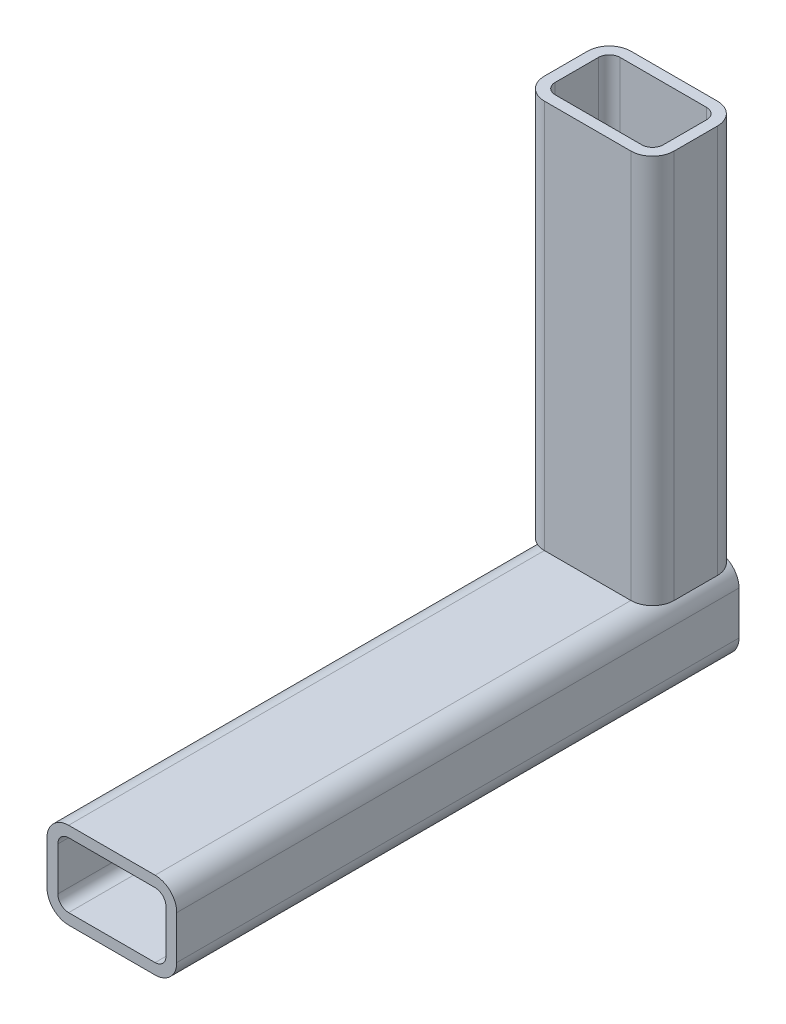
ISO-10303-21;
HEADER;
FILE_DESCRIPTION(('STEP AP214'),'2;1');
FILE_NAME('part.step','',(''),(''),'','','');
FILE_SCHEMA(('AUTOMOTIVE_DESIGN { 1 0 10303 214 1 1 1 1 }'));
ENDSEC;
DATA;
#1=APPLICATION_CONTEXT('core data for automotive mechanical design processes');
#2=APPLICATION_PROTOCOL_DEFINITION('international standard','automotive_design',2000,#1);
#3=PRODUCT_CONTEXT('',#1,'mechanical');
#4=PRODUCT('Part','Part','',(#3));
#5=PRODUCT_RELATED_PRODUCT_CATEGORY('part','',(#4));
#6=PRODUCT_DEFINITION_FORMATION('','',#4);
#7=PRODUCT_DEFINITION_CONTEXT('part definition',#1,'design');
#8=PRODUCT_DEFINITION('design','',#6,#7);
#9=PRODUCT_DEFINITION_SHAPE('','',#8);
#10=(LENGTH_UNIT() NAMED_UNIT(*) SI_UNIT(.MILLI.,.METRE.));
#11=(NAMED_UNIT(*) PLANE_ANGLE_UNIT() SI_UNIT($,.RADIAN.));
#12=(NAMED_UNIT(*) SI_UNIT($,.STERADIAN.) SOLID_ANGLE_UNIT());
#13=UNCERTAINTY_MEASURE_WITH_UNIT(LENGTH_MEASURE(1.E-05),#10,'distance_accuracy_value','');
#14=(GEOMETRIC_REPRESENTATION_CONTEXT(3) GLOBAL_UNCERTAINTY_ASSIGNED_CONTEXT((#13)) GLOBAL_UNIT_ASSIGNED_CONTEXT((#10,
#11,#12)) REPRESENTATION_CONTEXT('',''));
#15=CARTESIAN_POINT('',(0.,0.,0.));
#16=DIRECTION('',(0.,0.,1.));
#17=DIRECTION('',(1.,0.,0.));
#18=AXIS2_PLACEMENT_3D('',#15,#16,#17);
#19=CARTESIAN_POINT('',(-25.4,-12.699978,0.));
#20=DIRECTION('',(0.,0.,1.));
#21=DIRECTION('',(0.,-1.,0.));
#22=AXIS2_PLACEMENT_3D('',#19,#20,#21);
#23=CYLINDRICAL_SURFACE('',#22,12.7);
#24=CARTESIAN_POINT('',(-25.4,-12.699978,-25.399978));
#25=DIRECTION('',(0.,0.,-1.));
#26=DIRECTION('',(-1.,0.,0.));
#27=AXIS2_PLACEMENT_3D('',#24,#25,#26);
#28=CIRCLE('',#27,12.7);
#29=CARTESIAN_POINT('',(-25.4,-25.399978,-25.399978));
#30=VERTEX_POINT('',#29);
#31=CARTESIAN_POINT('',(-38.1,-12.699978,-25.399978));
#32=VERTEX_POINT('',#31);
#33=EDGE_CURVE('E175',#30,#32,#28,.T.);
#34=ORIENTED_EDGE('',*,*,#33,.F.);
#35=DIRECTION('',(0.,0.,1.));
#36=VECTOR('',#35,1.);
#37=CARTESIAN_POINT('',(-25.4,-25.399978,0.));
#38=LINE('',#37,#36);
#39=CARTESIAN_POINT('',(-25.4,-25.399978,304.8));
#40=VERTEX_POINT('',#39);
#41=EDGE_CURVE('E171',#30,#40,#38,.T.);
#42=ORIENTED_EDGE('',*,*,#41,.T.);
#43=CARTESIAN_POINT('',(-25.4,-12.699978,304.8));
#44=DIRECTION('',(0.,0.,-1.));
#45=DIRECTION('',(0.,1.,0.));
#46=AXIS2_PLACEMENT_3D('',#43,#44,#45);
#47=CIRCLE('',#46,12.7);
#48=CARTESIAN_POINT('',(-38.1,-12.699978,304.8));
#49=VERTEX_POINT('',#48);
#50=EDGE_CURVE('E226',#40,#49,#47,.T.);
#51=ORIENTED_EDGE('',*,*,#50,.T.);
#52=DIRECTION('',(0.,0.,1.));
#53=VECTOR('',#52,1.);
#54=CARTESIAN_POINT('',(-38.1,-12.699978,0.));
#55=LINE('',#54,#53);
#56=EDGE_CURVE('E223',#32,#49,#55,.T.);
#57=ORIENTED_EDGE('',*,*,#56,.F.);
#58=EDGE_LOOP('',(#34,#42,#51,#57));
#59=FACE_BOUND('',#58,.T.);
#60=ADVANCED_FACE('F46',(#59),#23,.T.);
#61=CARTESIAN_POINT('',(-38.1,-12.699978,0.));
#62=DIRECTION('',(1.,0.,0.));
#63=DIRECTION('',(0.,0.,-1.));
#64=AXIS2_PLACEMENT_3D('',#61,#62,#63);
#65=PLANE('',#64);
#66=DIRECTION('',(0.,1.,0.));
#67=VECTOR('',#66,1.);
#68=CARTESIAN_POINT('',(-38.1,-12.699978,-25.399978));
#69=LINE('',#68,#67);
#70=CARTESIAN_POINT('',(-38.1,12.699978,-25.399978));
#71=VERTEX_POINT('',#70);
#72=EDGE_CURVE('E193',#32,#71,#69,.T.);
#73=ORIENTED_EDGE('',*,*,#72,.F.);
#74=ORIENTED_EDGE('',*,*,#56,.T.);
#75=DIRECTION('',(0.,1.,0.));
#76=VECTOR('',#75,1.);
#77=CARTESIAN_POINT('',(-38.1,-12.699978,304.8));
#78=LINE('',#77,#76);
#79=CARTESIAN_POINT('',(-38.1,12.699978,304.8));
#80=VERTEX_POINT('',#79);
#81=EDGE_CURVE('E225',#49,#80,#78,.T.);
#82=ORIENTED_EDGE('',*,*,#81,.T.);
#83=DIRECTION('',(0.,0.,1.));
#84=VECTOR('',#83,1.);
#85=CARTESIAN_POINT('',(-38.1,12.699978,0.));
#86=LINE('',#85,#84);
#87=EDGE_CURVE('E227',#71,#80,#86,.T.);
#88=ORIENTED_EDGE('',*,*,#87,.F.);
#89=EDGE_LOOP('',(#73,#74,#82,#88));
#90=FACE_BOUND('',#89,.T.);
#91=ADVANCED_FACE('F298',(#90),#65,.F.);
#92=CARTESIAN_POINT('',(-25.4,12.699978,0.));
#93=DIRECTION('',(0.,0.,1.));
#94=DIRECTION('',(0.,-1.,0.));
#95=AXIS2_PLACEMENT_3D('',#92,#93,#94);
#96=CYLINDRICAL_SURFACE('',#95,12.7);
#97=CARTESIAN_POINT('',(-25.4,12.699978,-25.399978));
#98=DIRECTION('',(0.,0.,-1.));
#99=DIRECTION('',(-1.,0.,0.));
#100=AXIS2_PLACEMENT_3D('',#97,#98,#99);
#101=CIRCLE('',#100,12.7);
#102=CARTESIAN_POINT('',(-25.4,25.399978,-25.399978));
#103=VERTEX_POINT('',#102);
#104=EDGE_CURVE('E190',#71,#103,#101,.T.);
#105=ORIENTED_EDGE('',*,*,#104,.F.);
#106=ORIENTED_EDGE('',*,*,#87,.T.);
#107=CARTESIAN_POINT('',(-25.4,12.699978,304.8));
#108=DIRECTION('',(0.,0.,-1.));
#109=DIRECTION('',(0.,1.,0.));
#110=AXIS2_PLACEMENT_3D('',#107,#108,#109);
#111=CIRCLE('',#110,12.7);
#112=CARTESIAN_POINT('',(-25.4,25.399978,304.8));
#113=VERTEX_POINT('',#112);
#114=EDGE_CURVE('E229',#80,#113,#111,.T.);
#115=ORIENTED_EDGE('',*,*,#114,.T.);
#116=DIRECTION('',(0.,0.,1.));
#117=VECTOR('',#116,1.);
#118=CARTESIAN_POINT('',(-25.4,25.399978,0.));
#119=LINE('',#118,#117);
#120=EDGE_CURVE('E230',#103,#113,#119,.T.);
#121=ORIENTED_EDGE('',*,*,#120,.F.);
#122=EDGE_LOOP('',(#105,#106,#115,#121));
#123=FACE_BOUND('',#122,.T.);
#124=ADVANCED_FACE('F300',(#123),#96,.T.);
#125=CARTESIAN_POINT('',(25.4,25.399978,0.));
#126=DIRECTION('',(0.,-1.,0.));
#127=DIRECTION('',(0.,0.,-1.));
#128=AXIS2_PLACEMENT_3D('',#125,#126,#127);
#129=PLANE('',#128);
#130=DIRECTION('',(1.,0.,0.));
#131=VECTOR('',#130,1.);
#132=CARTESIAN_POINT('',(25.4,25.399978,-25.399978));
#133=LINE('',#132,#131);
#134=CARTESIAN_POINT('',(25.4,25.399978,-25.399978));
#135=VERTEX_POINT('',#134);
#136=EDGE_CURVE('E185',#103,#135,#133,.T.);
#137=ORIENTED_EDGE('',*,*,#136,.F.);
#138=ORIENTED_EDGE('',*,*,#120,.T.);
#139=DIRECTION('',(1.,0.,0.));
#140=VECTOR('',#139,1.);
#141=CARTESIAN_POINT('',(25.4,25.399978,304.8));
#142=LINE('',#141,#140);
#143=CARTESIAN_POINT('',(25.4,25.399978,304.8));
#144=VERTEX_POINT('',#143);
#145=EDGE_CURVE('E232',#113,#144,#142,.T.);
#146=ORIENTED_EDGE('',*,*,#145,.T.);
#147=DIRECTION('',(0.,0.,1.));
#148=VECTOR('',#147,1.);
#149=CARTESIAN_POINT('',(25.4,25.399978,0.));
#150=LINE('',#149,#148);
#151=EDGE_CURVE('E233',#135,#144,#150,.T.);
#152=ORIENTED_EDGE('',*,*,#151,.F.);
#153=EDGE_LOOP('',(#137,#138,#146,#152));
#154=FACE_BOUND('',#153,.T.);
#155=ADVANCED_FACE('F304',(#154),#129,.F.);
#156=CARTESIAN_POINT('',(25.4,12.699978,0.));
#157=DIRECTION('',(0.,0.,1.));
#158=DIRECTION('',(0.,-1.,0.));
#159=AXIS2_PLACEMENT_3D('',#156,#157,#158);
#160=CYLINDRICAL_SURFACE('',#159,12.7);
#161=CARTESIAN_POINT('',(25.4,12.699978,-25.399978));
#162=DIRECTION('',(0.,0.,-1.));
#163=DIRECTION('',(-1.,0.,0.));
#164=AXIS2_PLACEMENT_3D('',#161,#162,#163);
#165=CIRCLE('',#164,12.7);
#166=CARTESIAN_POINT('',(38.1,12.699978,-25.399978));
#167=VERTEX_POINT('',#166);
#168=EDGE_CURVE('E181',#135,#167,#165,.T.);
#169=ORIENTED_EDGE('',*,*,#168,.F.);
#170=ORIENTED_EDGE('',*,*,#151,.T.);
#171=CARTESIAN_POINT('',(25.4,12.699978,304.8));
#172=DIRECTION('',(0.,0.,-1.));
#173=DIRECTION('',(0.,1.,0.));
#174=AXIS2_PLACEMENT_3D('',#171,#172,#173);
#175=CIRCLE('',#174,12.7);
#176=CARTESIAN_POINT('',(38.1,12.699978,304.8));
#177=VERTEX_POINT('',#176);
#178=EDGE_CURVE('E235',#144,#177,#175,.T.);
#179=ORIENTED_EDGE('',*,*,#178,.T.);
#180=DIRECTION('',(0.,0.,1.));
#181=VECTOR('',#180,1.);
#182=CARTESIAN_POINT('',(38.1,12.699978,0.));
#183=LINE('',#182,#181);
#184=EDGE_CURVE('E236',#167,#177,#183,.T.);
#185=ORIENTED_EDGE('',*,*,#184,.F.);
#186=EDGE_LOOP('',(#169,#170,#179,#185));
#187=FACE_BOUND('',#186,.T.);
#188=ADVANCED_FACE('F308',(#187),#160,.T.);
#189=CARTESIAN_POINT('',(38.1,12.699978,0.));
#190=DIRECTION('',(-1.,0.,0.));
#191=DIRECTION('',(0.,0.,1.));
#192=AXIS2_PLACEMENT_3D('',#189,#190,#191);
#193=PLANE('',#192);
#194=DIRECTION('',(0.,-1.,0.));
#195=VECTOR('',#194,1.);
#196=CARTESIAN_POINT('',(38.1,12.699978,-25.399978));
#197=LINE('',#196,#195);
#198=CARTESIAN_POINT('',(38.1,-12.699978,-25.399978));
#199=VERTEX_POINT('',#198);
#200=EDGE_CURVE('E56',#167,#199,#197,.T.);
#201=ORIENTED_EDGE('',*,*,#200,.F.);
#202=ORIENTED_EDGE('',*,*,#184,.T.);
#203=DIRECTION('',(0.,-1.,0.));
#204=VECTOR('',#203,1.);
#205=CARTESIAN_POINT('',(38.1,12.699978,304.8));
#206=LINE('',#205,#204);
#207=CARTESIAN_POINT('',(38.1,-12.699978,304.8));
#208=VERTEX_POINT('',#207);
#209=EDGE_CURVE('E238',#177,#208,#206,.T.);
#210=ORIENTED_EDGE('',*,*,#209,.T.);
#211=DIRECTION('',(0.,0.,1.));
#212=VECTOR('',#211,1.);
#213=CARTESIAN_POINT('',(38.1,-12.699978,0.));
#214=LINE('',#213,#212);
#215=EDGE_CURVE('E239',#199,#208,#214,.T.);
#216=ORIENTED_EDGE('',*,*,#215,.F.);
#217=EDGE_LOOP('',(#201,#202,#210,#216));
#218=FACE_BOUND('',#217,.T.);
#219=ADVANCED_FACE('F310',(#218),#193,.F.);
#220=CARTESIAN_POINT('',(25.4,-12.699978,0.));
#221=DIRECTION('',(0.,0.,1.));
#222=DIRECTION('',(0.,-1.,0.));
#223=AXIS2_PLACEMENT_3D('',#220,#221,#222);
#224=CYLINDRICAL_SURFACE('',#223,12.7);
#225=CARTESIAN_POINT('',(25.4,-12.699978,-25.399978));
#226=DIRECTION('',(0.,0.,-1.));
#227=DIRECTION('',(-1.,0.,0.));
#228=AXIS2_PLACEMENT_3D('',#225,#226,#227);
#229=CIRCLE('',#228,12.7);
#230=CARTESIAN_POINT('',(25.4,-25.399978,-25.399978));
#231=VERTEX_POINT('',#230);
#232=EDGE_CURVE('E12',#199,#231,#229,.T.);
#233=ORIENTED_EDGE('',*,*,#232,.F.);
#234=ORIENTED_EDGE('',*,*,#215,.T.);
#235=CARTESIAN_POINT('',(25.4,-12.699978,304.8));
#236=DIRECTION('',(0.,0.,-1.));
#237=DIRECTION('',(0.,1.,0.));
#238=AXIS2_PLACEMENT_3D('',#235,#236,#237);
#239=CIRCLE('',#238,12.7);
#240=CARTESIAN_POINT('',(25.4,-25.399978,304.8));
#241=VERTEX_POINT('',#240);
#242=EDGE_CURVE('E160',#208,#241,#239,.T.);
#243=ORIENTED_EDGE('',*,*,#242,.T.);
#244=DIRECTION('',(0.,0.,1.));
#245=VECTOR('',#244,1.);
#246=CARTESIAN_POINT('',(25.4,-25.399978,0.));
#247=LINE('',#246,#245);
#248=EDGE_CURVE('E155',#231,#241,#247,.T.);
#249=ORIENTED_EDGE('',*,*,#248,.F.);
#250=EDGE_LOOP('',(#233,#234,#243,#249));
#251=FACE_BOUND('',#250,.T.);
#252=ADVANCED_FACE('F157',(#251),#224,.T.);
#253=CARTESIAN_POINT('',(-25.4,12.699978,0.));
#254=DIRECTION('',(0.,0.,1.));
#255=DIRECTION('',(0.,-1.,0.));
#256=AXIS2_PLACEMENT_3D('',#253,#254,#255);
#257=CYLINDRICAL_SURFACE('',#256,6.35);
#258=DIRECTION('',(0.,0.,1.));
#259=VECTOR('',#258,1.);
#260=CARTESIAN_POINT('',(-31.75,12.699978,0.));
#261=LINE('',#260,#259);
#262=CARTESIAN_POINT('',(-31.75,12.6999780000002,-25.399978));
#263=VERTEX_POINT('',#262);
#264=CARTESIAN_POINT('',(-31.75,12.699978,304.8));
#265=VERTEX_POINT('',#264);
#266=EDGE_CURVE('E202',#263,#265,#261,.T.);
#267=ORIENTED_EDGE('',*,*,#266,.F.);
#268=CARTESIAN_POINT('',(-25.4,12.699978,-25.399978));
#269=DIRECTION('',(0.,0.,-1.));
#270=DIRECTION('',(-1.,0.,0.));
#271=AXIS2_PLACEMENT_3D('',#268,#269,#270);
#272=CIRCLE('',#271,6.35);
#273=CARTESIAN_POINT('',(-25.4,19.049978,-25.399978));
#274=VERTEX_POINT('',#273);
#275=EDGE_CURVE('E197',#263,#274,#272,.T.);
#276=ORIENTED_EDGE('',*,*,#275,.T.);
#277=DIRECTION('',(0.,0.,1.));
#278=VECTOR('',#277,1.);
#279=CARTESIAN_POINT('',(-25.4,19.049978,0.));
#280=LINE('',#279,#278);
#281=CARTESIAN_POINT('',(-25.4,19.049978,304.8));
#282=VERTEX_POINT('',#281);
#283=EDGE_CURVE('E50',#274,#282,#280,.T.);
#284=ORIENTED_EDGE('',*,*,#283,.T.);
#285=CARTESIAN_POINT('',(-25.4,12.699978,304.8));
#286=DIRECTION('',(0.,0.,-1.));
#287=DIRECTION('',(0.,1.,0.));
#288=AXIS2_PLACEMENT_3D('',#285,#286,#287);
#289=CIRCLE('',#288,6.35);
#290=EDGE_CURVE('E253',#265,#282,#289,.T.);
#291=ORIENTED_EDGE('',*,*,#290,.F.);
#292=EDGE_LOOP('',(#267,#276,#284,#291));
#293=FACE_BOUND('',#292,.T.);
#294=ADVANCED_FACE('F317',(#293),#257,.F.);
#295=CARTESIAN_POINT('',(-31.75,-12.699978,0.));
#296=DIRECTION('',(1.,0.,0.));
#297=DIRECTION('',(0.,0.,-1.));
#298=AXIS2_PLACEMENT_3D('',#295,#296,#297);
#299=PLANE('',#298);
#300=DIRECTION('',(0.,0.,1.));
#301=VECTOR('',#300,1.);
#302=CARTESIAN_POINT('',(-31.75,-12.699978,0.));
#303=LINE('',#302,#301);
#304=CARTESIAN_POINT('',(-31.75,-12.699978,-25.399978));
#305=VERTEX_POINT('',#304);
#306=CARTESIAN_POINT('',(-31.75,-12.699978,304.8));
#307=VERTEX_POINT('',#306);
#308=EDGE_CURVE('E206',#305,#307,#303,.T.);
#309=ORIENTED_EDGE('',*,*,#308,.F.);
#310=DIRECTION('',(0.,1.,0.));
#311=VECTOR('',#310,1.);
#312=CARTESIAN_POINT('',(-31.75,-12.699978,-25.399978));
#313=LINE('',#312,#311);
#314=EDGE_CURVE('E199',#305,#263,#313,.T.);
#315=ORIENTED_EDGE('',*,*,#314,.T.);
#316=ORIENTED_EDGE('',*,*,#266,.T.);
#317=DIRECTION('',(0.,1.,0.));
#318=VECTOR('',#317,1.);
#319=CARTESIAN_POINT('',(-31.75,-12.699978,304.8));
#320=LINE('',#319,#318);
#321=EDGE_CURVE('E176',#307,#265,#320,.T.);
#322=ORIENTED_EDGE('',*,*,#321,.F.);
#323=EDGE_LOOP('',(#309,#315,#316,#322));
#324=FACE_BOUND('',#323,.T.);
#325=ADVANCED_FACE('F359',(#324),#299,.T.);
#326=CARTESIAN_POINT('',(-25.4,-12.699978,0.));
#327=DIRECTION('',(0.,0.,1.));
#328=DIRECTION('',(0.,-1.,0.));
#329=AXIS2_PLACEMENT_3D('',#326,#327,#328);
#330=CYLINDRICAL_SURFACE('',#329,6.35);
#331=DIRECTION('',(0.,0.,1.));
#332=VECTOR('',#331,1.);
#333=CARTESIAN_POINT('',(-25.4,-19.049978,0.));
#334=LINE('',#333,#332);
#335=CARTESIAN_POINT('',(-25.4,-19.049978,-25.399978));
#336=VERTEX_POINT('',#335);
#337=CARTESIAN_POINT('',(-25.4,-19.049978,304.8));
#338=VERTEX_POINT('',#337);
#339=EDGE_CURVE('E210',#336,#338,#334,.T.);
#340=ORIENTED_EDGE('',*,*,#339,.F.);
#341=CARTESIAN_POINT('',(-25.4,-12.699978,-25.399978));
#342=DIRECTION('',(0.,0.,-1.));
#343=DIRECTION('',(-1.,0.,0.));
#344=AXIS2_PLACEMENT_3D('',#341,#342,#343);
#345=CIRCLE('',#344,6.35);
#346=EDGE_CURVE('E203',#336,#305,#345,.T.);
#347=ORIENTED_EDGE('',*,*,#346,.T.);
#348=ORIENTED_EDGE('',*,*,#308,.T.);
#349=CARTESIAN_POINT('',(-25.4,-12.699978,304.8));
#350=DIRECTION('',(0.,0.,-1.));
#351=DIRECTION('',(0.,1.,0.));
#352=AXIS2_PLACEMENT_3D('',#349,#350,#351);
#353=CIRCLE('',#352,6.35);
#354=EDGE_CURVE('E259',#338,#307,#353,.T.);
#355=ORIENTED_EDGE('',*,*,#354,.F.);
#356=EDGE_LOOP('',(#340,#347,#348,#355));
#357=FACE_BOUND('',#356,.T.);
#358=ADVANCED_FACE('F370',(#357),#330,.F.);
#359=CARTESIAN_POINT('',(-25.4,-19.049978,0.));
#360=DIRECTION('',(0.,1.,0.));
#361=DIRECTION('',(0.,0.,1.));
#362=AXIS2_PLACEMENT_3D('',#359,#360,#361);
#363=PLANE('',#362);
#364=DIRECTION('',(0.,0.,1.));
#365=VECTOR('',#364,1.);
#366=CARTESIAN_POINT('',(25.4,-19.049978,0.));
#367=LINE('',#366,#365);
#368=CARTESIAN_POINT('',(25.4,-19.049978,-25.399978));
#369=VERTEX_POINT('',#368);
#370=CARTESIAN_POINT('',(25.4,-19.049978,304.8));
#371=VERTEX_POINT('',#370);
#372=EDGE_CURVE('E214',#369,#371,#367,.T.);
#373=ORIENTED_EDGE('',*,*,#372,.F.);
#374=DIRECTION('',(-1.,0.,0.));
#375=VECTOR('',#374,1.);
#376=CARTESIAN_POINT('',(-25.4,-19.049978,-25.399978));
#377=LINE('',#376,#375);
#378=EDGE_CURVE('E207',#369,#336,#377,.T.);
#379=ORIENTED_EDGE('',*,*,#378,.T.);
#380=ORIENTED_EDGE('',*,*,#339,.T.);
#381=DIRECTION('',(-1.,0.,0.));
#382=VECTOR('',#381,1.);
#383=CARTESIAN_POINT('',(-25.4,-19.049978,304.8));
#384=LINE('',#383,#382);
#385=EDGE_CURVE('E262',#371,#338,#384,.T.);
#386=ORIENTED_EDGE('',*,*,#385,.F.);
#387=EDGE_LOOP('',(#373,#379,#380,#386));
#388=FACE_BOUND('',#387,.T.);
#389=ADVANCED_FACE('F381',(#388),#363,.T.);
#390=CARTESIAN_POINT('',(25.4,-12.699978,0.));
#391=DIRECTION('',(0.,0.,1.));
#392=DIRECTION('',(0.,-1.,0.));
#393=AXIS2_PLACEMENT_3D('',#390,#391,#392);
#394=CYLINDRICAL_SURFACE('',#393,6.35);
#395=DIRECTION('',(0.,0.,1.));
#396=VECTOR('',#395,1.);
#397=CARTESIAN_POINT('',(31.75,-12.699978,0.));
#398=LINE('',#397,#396);
#399=CARTESIAN_POINT('',(31.75,-12.699978,-25.399978));
#400=VERTEX_POINT('',#399);
#401=CARTESIAN_POINT('',(31.75,-12.699978,304.8));
#402=VERTEX_POINT('',#401);
#403=EDGE_CURVE('E218',#400,#402,#398,.T.);
#404=ORIENTED_EDGE('',*,*,#403,.F.);
#405=CARTESIAN_POINT('',(25.4,-12.699978,-25.399978));
#406=DIRECTION('',(0.,0.,-1.));
#407=DIRECTION('',(-1.,0.,0.));
#408=AXIS2_PLACEMENT_3D('',#405,#406,#407);
#409=CIRCLE('',#408,6.35);
#410=EDGE_CURVE('E211',#400,#369,#409,.T.);
#411=ORIENTED_EDGE('',*,*,#410,.T.);
#412=ORIENTED_EDGE('',*,*,#372,.T.);
#413=CARTESIAN_POINT('',(25.4,-12.699978,304.8));
#414=DIRECTION('',(0.,0.,-1.));
#415=DIRECTION('',(0.,1.,0.));
#416=AXIS2_PLACEMENT_3D('',#413,#414,#415);
#417=CIRCLE('',#416,6.35);
#418=EDGE_CURVE('E265',#402,#371,#417,.T.);
#419=ORIENTED_EDGE('',*,*,#418,.F.);
#420=EDGE_LOOP('',(#404,#411,#412,#419));
#421=FACE_BOUND('',#420,.T.);
#422=ADVANCED_FACE('F392',(#421),#394,.F.);
#423=CARTESIAN_POINT('',(31.75,12.699978,0.));
#424=DIRECTION('',(-1.,0.,0.));
#425=DIRECTION('',(0.,0.,1.));
#426=AXIS2_PLACEMENT_3D('',#423,#424,#425);
#427=PLANE('',#426);
#428=DIRECTION('',(0.,0.,1.));
#429=VECTOR('',#428,1.);
#430=CARTESIAN_POINT('',(31.75,12.699978,0.));
#431=LINE('',#430,#429);
#432=CARTESIAN_POINT('',(31.75,12.6999780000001,-25.399978));
#433=VERTEX_POINT('',#432);
#434=CARTESIAN_POINT('',(31.75,12.699978,304.8));
#435=VERTEX_POINT('',#434);
#436=EDGE_CURVE('E221',#433,#435,#431,.T.);
#437=ORIENTED_EDGE('',*,*,#436,.F.);
#438=DIRECTION('',(0.,-1.,0.));
#439=VECTOR('',#438,1.);
#440=CARTESIAN_POINT('',(31.75,12.699978,-25.399978));
#441=LINE('',#440,#439);
#442=EDGE_CURVE('E215',#433,#400,#441,.T.);
#443=ORIENTED_EDGE('',*,*,#442,.T.);
#444=ORIENTED_EDGE('',*,*,#403,.T.);
#445=DIRECTION('',(0.,-1.,0.));
#446=VECTOR('',#445,1.);
#447=CARTESIAN_POINT('',(31.75,12.699978,304.8));
#448=LINE('',#447,#446);
#449=EDGE_CURVE('E268',#435,#402,#448,.T.);
#450=ORIENTED_EDGE('',*,*,#449,.F.);
#451=EDGE_LOOP('',(#437,#443,#444,#450));
#452=FACE_BOUND('',#451,.T.);
#453=ADVANCED_FACE('F403',(#452),#427,.T.);
#454=CARTESIAN_POINT('',(25.4,12.699978,0.));
#455=DIRECTION('',(0.,0.,1.));
#456=DIRECTION('',(0.,-1.,0.));
#457=AXIS2_PLACEMENT_3D('',#454,#455,#456);
#458=CYLINDRICAL_SURFACE('',#457,6.35);
#459=DIRECTION('',(0.,0.,1.));
#460=VECTOR('',#459,1.);
#461=CARTESIAN_POINT('',(25.4,19.049978,0.));
#462=LINE('',#461,#460);
#463=CARTESIAN_POINT('',(25.4,19.049978,-25.399978));
#464=VERTEX_POINT('',#463);
#465=CARTESIAN_POINT('',(25.4,19.049978,304.8));
#466=VERTEX_POINT('',#465);
#467=EDGE_CURVE('E165',#464,#466,#462,.T.);
#468=ORIENTED_EDGE('',*,*,#467,.F.);
#469=CARTESIAN_POINT('',(25.4,12.699978,-25.399978));
#470=DIRECTION('',(0.,0.,-1.));
#471=DIRECTION('',(-1.,0.,0.));
#472=AXIS2_PLACEMENT_3D('',#469,#470,#471);
#473=CIRCLE('',#472,6.35);
#474=EDGE_CURVE('E219',#464,#433,#473,.T.);
#475=ORIENTED_EDGE('',*,*,#474,.T.);
#476=ORIENTED_EDGE('',*,*,#436,.T.);
#477=CARTESIAN_POINT('',(25.4,12.699978,304.8));
#478=DIRECTION('',(0.,0.,-1.));
#479=DIRECTION('',(0.,1.,0.));
#480=AXIS2_PLACEMENT_3D('',#477,#478,#479);
#481=CIRCLE('',#480,6.35);
#482=EDGE_CURVE('E271',#466,#435,#481,.T.);
#483=ORIENTED_EDGE('',*,*,#482,.F.);
#484=EDGE_LOOP('',(#468,#475,#476,#483));
#485=FACE_BOUND('',#484,.T.);
#486=ADVANCED_FACE('F414',(#485),#458,.F.);
#487=CARTESIAN_POINT('',(25.4,19.049978,0.));
#488=DIRECTION('',(0.,-1.,0.));
#489=DIRECTION('',(0.,0.,-1.));
#490=AXIS2_PLACEMENT_3D('',#487,#488,#489);
#491=PLANE('',#490);
#492=ORIENTED_EDGE('',*,*,#283,.F.);
#493=DIRECTION('',(1.,0.,0.));
#494=VECTOR('',#493,1.);
#495=CARTESIAN_POINT('',(25.4,19.049978,-25.399978));
#496=LINE('',#495,#494);
#497=EDGE_CURVE('E64',#274,#464,#496,.T.);
#498=ORIENTED_EDGE('',*,*,#497,.T.);
#499=ORIENTED_EDGE('',*,*,#467,.T.);
#500=DIRECTION('',(1.,0.,0.));
#501=VECTOR('',#500,1.);
#502=CARTESIAN_POINT('',(25.4,19.049978,304.8));
#503=LINE('',#502,#501);
#504=EDGE_CURVE('E256',#282,#466,#503,.T.);
#505=ORIENTED_EDGE('',*,*,#504,.F.);
#506=EDGE_LOOP('',(#492,#498,#499,#505));
#507=FACE_BOUND('',#506,.T.);
#508=ADVANCED_FACE('F425',(#507),#491,.T.);
#509=CARTESIAN_POINT('',(-25.4,-25.399978,0.));
#510=DIRECTION('',(0.,1.,0.));
#511=DIRECTION('',(0.,0.,1.));
#512=AXIS2_PLACEMENT_3D('',#509,#510,#511);
#513=PLANE('',#512);
#514=DIRECTION('',(-1.,0.,0.));
#515=VECTOR('',#514,1.);
#516=CARTESIAN_POINT('',(-25.4,-25.399978,-25.399978));
#517=LINE('',#516,#515);
#518=EDGE_CURVE('E169',#231,#30,#517,.T.);
#519=ORIENTED_EDGE('',*,*,#518,.F.);
#520=ORIENTED_EDGE('',*,*,#248,.T.);
#521=DIRECTION('',(-1.,0.,0.));
#522=VECTOR('',#521,1.);
#523=CARTESIAN_POINT('',(-25.4,-25.399978,304.8));
#524=LINE('',#523,#522);
#525=EDGE_CURVE('E164',#241,#40,#524,.T.);
#526=ORIENTED_EDGE('',*,*,#525,.T.);
#527=ORIENTED_EDGE('',*,*,#41,.F.);
#528=EDGE_LOOP('',(#519,#520,#526,#527));
#529=FACE_BOUND('',#528,.T.);
#530=ADVANCED_FACE('F170',(#529),#513,.F.);
#531=CARTESIAN_POINT('',(-25.4,-12.699978,304.8));
#532=DIRECTION('',(0.,0.,-1.));
#533=DIRECTION('',(0.,1.,0.));
#534=AXIS2_PLACEMENT_3D('',#531,#532,#533);
#535=PLANE('',#534);
#536=ORIENTED_EDGE('',*,*,#290,.T.);
#537=ORIENTED_EDGE('',*,*,#504,.T.);
#538=ORIENTED_EDGE('',*,*,#482,.T.);
#539=ORIENTED_EDGE('',*,*,#449,.T.);
#540=ORIENTED_EDGE('',*,*,#418,.T.);
#541=ORIENTED_EDGE('',*,*,#385,.T.);
#542=ORIENTED_EDGE('',*,*,#354,.T.);
#543=ORIENTED_EDGE('',*,*,#321,.T.);
#544=EDGE_LOOP('',(#536,#537,#538,#539,#540,#541,#542,#543));
#545=FACE_BOUND('',#544,.T.);
#546=ORIENTED_EDGE('',*,*,#50,.F.);
#547=ORIENTED_EDGE('',*,*,#525,.F.);
#548=ORIENTED_EDGE('',*,*,#242,.F.);
#549=ORIENTED_EDGE('',*,*,#209,.F.);
#550=ORIENTED_EDGE('',*,*,#178,.F.);
#551=ORIENTED_EDGE('',*,*,#145,.F.);
#552=ORIENTED_EDGE('',*,*,#114,.F.);
#553=ORIENTED_EDGE('',*,*,#81,.F.);
#554=EDGE_LOOP('',(#546,#547,#548,#549,#550,#551,#552,#553));
#555=FACE_BOUND('',#554,.T.);
#556=ADVANCED_FACE('F292',(#545,#555),#535,.F.);
#557=CARTESIAN_POINT('',(38.1,0.,-25.399978));
#558=DIRECTION('',(0.,0.,-1.));
#559=DIRECTION('',(-1.,0.,0.));
#560=AXIS2_PLACEMENT_3D('',#557,#558,#559);
#561=PLANE('',#560);
#562=ORIENTED_EDGE('',*,*,#275,.F.);
#563=ORIENTED_EDGE('',*,*,#314,.F.);
#564=ORIENTED_EDGE('',*,*,#346,.F.);
#565=ORIENTED_EDGE('',*,*,#378,.F.);
#566=ORIENTED_EDGE('',*,*,#410,.F.);
#567=ORIENTED_EDGE('',*,*,#442,.F.);
#568=ORIENTED_EDGE('',*,*,#474,.F.);
#569=ORIENTED_EDGE('',*,*,#497,.F.);
#570=EDGE_LOOP('',(#562,#563,#564,#565,#566,#567,#568,#569));
#571=FACE_BOUND('',#570,.T.);
#572=ORIENTED_EDGE('',*,*,#518,.T.);
#573=ORIENTED_EDGE('',*,*,#33,.T.);
#574=ORIENTED_EDGE('',*,*,#72,.T.);
#575=ORIENTED_EDGE('',*,*,#104,.T.);
#576=ORIENTED_EDGE('',*,*,#136,.T.);
#577=ORIENTED_EDGE('',*,*,#168,.T.);
#578=ORIENTED_EDGE('',*,*,#200,.T.);
#579=ORIENTED_EDGE('',*,*,#232,.T.);
#580=EDGE_LOOP('',(#572,#573,#574,#575,#576,#577,#578,#579));
#581=FACE_BOUND('',#580,.T.);
#582=ADVANCED_FACE('F48',(#571,#581),#561,.T.);
#583=CLOSED_SHELL('',(#60,#91,#124,#155,#188,#219,#252,#294,#325,#358,#389,#422,#453,#486,#508,
#530,#556,#582));
#584=MANIFOLD_SOLID_BREP('B2',#583);
#585=CARTESIAN_POINT('',(-25.4,254.,-12.699978));
#586=DIRECTION('',(0.,-1.,0.));
#587=DIRECTION('',(0.,0.,-1.));
#588=AXIS2_PLACEMENT_3D('',#585,#586,#587);
#589=CYLINDRICAL_SURFACE('',#588,12.7);
#590=CARTESIAN_POINT('',(-25.4,25.399978,-12.699978));
#591=DIRECTION('',(0.,-1.,0.));
#592=DIRECTION('',(0.,0.,-1.));
#593=AXIS2_PLACEMENT_3D('',#590,#591,#592);
#594=CIRCLE('',#593,12.7);
#595=CARTESIAN_POINT('',(-38.1,25.399978,-12.6999780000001));
#596=VERTEX_POINT('',#595);
#597=CARTESIAN_POINT('',(-25.4,25.399978,-25.399978));
#598=VERTEX_POINT('',#597);
#599=EDGE_CURVE('E687',#596,#598,#594,.T.);
#600=ORIENTED_EDGE('',*,*,#599,.F.);
#601=DIRECTION('',(0.,-1.,0.));
#602=VECTOR('',#601,1.);
#603=CARTESIAN_POINT('',(-38.1,254.,-12.699978));
#604=LINE('',#603,#602);
#605=CARTESIAN_POINT('',(-38.1,254.,-12.699978));
#606=VERTEX_POINT('',#605);
#607=EDGE_CURVE('E696',#606,#596,#604,.T.);
#608=ORIENTED_EDGE('',*,*,#607,.F.);
#609=CARTESIAN_POINT('',(-25.4,254.,-12.699978));
#610=DIRECTION('',(0.,1.,0.));
#611=DIRECTION('',(0.,0.,1.));
#612=AXIS2_PLACEMENT_3D('',#609,#610,#611);
#613=CIRCLE('',#612,12.7);
#614=CARTESIAN_POINT('',(-25.4,254.,-25.399978));
#615=VERTEX_POINT('',#614);
#616=EDGE_CURVE('E611',#615,#606,#613,.T.);
#617=ORIENTED_EDGE('',*,*,#616,.F.);
#618=DIRECTION('',(0.,-1.,0.));
#619=VECTOR('',#618,1.);
#620=CARTESIAN_POINT('',(-25.4,254.,-25.399978));
#621=LINE('',#620,#619);
#622=EDGE_CURVE('E693',#615,#598,#621,.T.);
#623=ORIENTED_EDGE('',*,*,#622,.T.);
#624=EDGE_LOOP('',(#600,#608,#617,#623));
#625=FACE_BOUND('',#624,.T.);
#626=ADVANCED_FACE('F519',(#625),#589,.T.);
#627=CARTESIAN_POINT('',(-38.1,254.,-12.699978));
#628=DIRECTION('',(1.,0.,0.));
#629=DIRECTION('',(0.,0.,-1.));
#630=AXIS2_PLACEMENT_3D('',#627,#628,#629);
#631=PLANE('',#630);
#632=DIRECTION('',(0.,0.,-1.));
#633=VECTOR('',#632,1.);
#634=CARTESIAN_POINT('',(-38.1,25.3999779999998,1898.31577403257));
#635=LINE('',#634,#633);
#636=CARTESIAN_POINT('',(-38.1,25.399978,12.699978));
#637=VERTEX_POINT('',#636);
#638=EDGE_CURVE('E671',#637,#596,#635,.T.);
#639=ORIENTED_EDGE('',*,*,#638,.F.);
#640=DIRECTION('',(0.,-1.,0.));
#641=VECTOR('',#640,1.);
#642=CARTESIAN_POINT('',(-38.1,254.,12.699978));
#643=LINE('',#642,#641);
#644=CARTESIAN_POINT('',(-38.1,254.,12.699978));
#645=VERTEX_POINT('',#644);
#646=EDGE_CURVE('E699',#645,#637,#643,.T.);
#647=ORIENTED_EDGE('',*,*,#646,.F.);
#648=DIRECTION('',(0.,0.,1.));
#649=VECTOR('',#648,1.);
#650=CARTESIAN_POINT('',(-38.1,254.,-12.699978));
#651=LINE('',#650,#649);
#652=EDGE_CURVE('E784',#606,#645,#651,.T.);
#653=ORIENTED_EDGE('',*,*,#652,.F.);
#654=ORIENTED_EDGE('',*,*,#607,.T.);
#655=EDGE_LOOP('',(#639,#647,#653,#654));
#656=FACE_BOUND('',#655,.T.);
#657=ADVANCED_FACE('F771',(#656),#631,.F.);
#658=CARTESIAN_POINT('',(-25.4,254.,12.699978));
#659=DIRECTION('',(0.,-1.,0.));
#660=DIRECTION('',(0.,0.,-1.));
#661=AXIS2_PLACEMENT_3D('',#658,#659,#660);
#662=CYLINDRICAL_SURFACE('',#661,12.7);
#663=CARTESIAN_POINT('',(-25.4,25.399978,12.699978));
#664=DIRECTION('',(0.,-1.,0.));
#665=DIRECTION('',(0.,0.,-1.));
#666=AXIS2_PLACEMENT_3D('',#663,#664,#665);
#667=CIRCLE('',#666,12.7);
#668=CARTESIAN_POINT('',(-25.4,25.399978,25.399978));
#669=VERTEX_POINT('',#668);
#670=EDGE_CURVE('E670',#669,#637,#667,.T.);
#671=ORIENTED_EDGE('',*,*,#670,.F.);
#672=DIRECTION('',(0.,-1.,0.));
#673=VECTOR('',#672,1.);
#674=CARTESIAN_POINT('',(-25.4,254.,25.399978));
#675=LINE('',#674,#673);
#676=CARTESIAN_POINT('',(-25.4,254.,25.399978));
#677=VERTEX_POINT('',#676);
#678=EDGE_CURVE('E701',#677,#669,#675,.T.);
#679=ORIENTED_EDGE('',*,*,#678,.F.);
#680=CARTESIAN_POINT('',(-25.4,254.,12.699978));
#681=DIRECTION('',(0.,1.,0.));
#682=DIRECTION('',(0.,0.,1.));
#683=AXIS2_PLACEMENT_3D('',#680,#681,#682);
#684=CIRCLE('',#683,12.7);
#685=EDGE_CURVE('E715',#645,#677,#684,.T.);
#686=ORIENTED_EDGE('',*,*,#685,.F.);
#687=ORIENTED_EDGE('',*,*,#646,.T.);
#688=EDGE_LOOP('',(#671,#679,#686,#687));
#689=FACE_BOUND('',#688,.T.);
#690=ADVANCED_FACE('F712',(#689),#662,.T.);
#691=CARTESIAN_POINT('',(25.4,254.,25.399978));
#692=DIRECTION('',(0.,0.,-1.));
#693=DIRECTION('',(-1.,0.,0.));
#694=AXIS2_PLACEMENT_3D('',#691,#692,#693);
#695=PLANE('',#694);
#696=DIRECTION('',(-1.,0.,0.));
#697=VECTOR('',#696,1.);
#698=CARTESIAN_POINT('',(25.4,25.399978,25.399978));
#699=LINE('',#698,#697);
#700=CARTESIAN_POINT('',(25.4,25.399978,25.399978));
#701=VERTEX_POINT('',#700);
#702=EDGE_CURVE('E44',#701,#669,#699,.T.);
#703=ORIENTED_EDGE('',*,*,#702,.F.);
#704=DIRECTION('',(0.,-1.,0.));
#705=VECTOR('',#704,1.);
#706=CARTESIAN_POINT('',(25.4,254.,25.399978));
#707=LINE('',#706,#705);
#708=CARTESIAN_POINT('',(25.4,254.,25.399978));
#709=VERTEX_POINT('',#708);
#710=EDGE_CURVE('E587',#709,#701,#707,.T.);
#711=ORIENTED_EDGE('',*,*,#710,.F.);
#712=DIRECTION('',(1.,0.,0.));
#713=VECTOR('',#712,1.);
#714=CARTESIAN_POINT('',(25.4,254.,25.399978));
#715=LINE('',#714,#713);
#716=EDGE_CURVE('E709',#677,#709,#715,.T.);
#717=ORIENTED_EDGE('',*,*,#716,.F.);
#718=ORIENTED_EDGE('',*,*,#678,.T.);
#719=EDGE_LOOP('',(#703,#711,#717,#718));
#720=FACE_BOUND('',#719,.T.);
#721=ADVANCED_FACE('F706',(#720),#695,.F.);
#722=CARTESIAN_POINT('',(25.4,254.,12.699978));
#723=DIRECTION('',(0.,-1.,0.));
#724=DIRECTION('',(0.,0.,-1.));
#725=AXIS2_PLACEMENT_3D('',#722,#723,#724);
#726=CYLINDRICAL_SURFACE('',#725,12.7);
#727=CARTESIAN_POINT('',(25.4,25.399978,12.699978));
#728=DIRECTION('',(0.,-1.,0.));
#729=DIRECTION('',(0.,0.,-1.));
#730=AXIS2_PLACEMENT_3D('',#727,#728,#729);
#731=CIRCLE('',#730,12.7);
#732=CARTESIAN_POINT('',(38.1,25.399978,12.6999780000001));
#733=VERTEX_POINT('',#732);
#734=EDGE_CURVE('E528',#733,#701,#731,.T.);
#735=ORIENTED_EDGE('',*,*,#734,.F.);
#736=DIRECTION('',(0.,-1.,0.));
#737=VECTOR('',#736,1.);
#738=CARTESIAN_POINT('',(38.1,254.,12.699978));
#739=LINE('',#738,#737);
#740=CARTESIAN_POINT('',(38.1,254.,12.699978));
#741=VERTEX_POINT('',#740);
#742=EDGE_CURVE('E586',#741,#733,#739,.T.);
#743=ORIENTED_EDGE('',*,*,#742,.F.);
#744=CARTESIAN_POINT('',(25.4,254.,12.699978));
#745=DIRECTION('',(0.,1.,0.));
#746=DIRECTION('',(0.,0.,1.));
#747=AXIS2_PLACEMENT_3D('',#744,#745,#746);
#748=CIRCLE('',#747,12.7);
#749=EDGE_CURVE('E804',#709,#741,#748,.T.);
#750=ORIENTED_EDGE('',*,*,#749,.F.);
#751=ORIENTED_EDGE('',*,*,#710,.T.);
#752=EDGE_LOOP('',(#735,#743,#750,#751));
#753=FACE_BOUND('',#752,.T.);
#754=ADVANCED_FACE('F592',(#753),#726,.T.);
#755=CARTESIAN_POINT('',(38.1,254.,12.699978));
#756=DIRECTION('',(-1.,0.,0.));
#757=DIRECTION('',(0.,0.,1.));
#758=AXIS2_PLACEMENT_3D('',#755,#756,#757);
#759=PLANE('',#758);
#760=DIRECTION('',(0.,0.,-1.));
#761=VECTOR('',#760,1.);
#762=CARTESIAN_POINT('',(38.1,25.3999779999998,1898.31577403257));
#763=LINE('',#762,#761);
#764=CARTESIAN_POINT('',(38.1,25.399978,-12.6999780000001));
#765=VERTEX_POINT('',#764);
#766=EDGE_CURVE('E579',#733,#765,#763,.T.);
#767=ORIENTED_EDGE('',*,*,#766,.T.);
#768=DIRECTION('',(0.,-1.,0.));
#769=VECTOR('',#768,1.);
#770=CARTESIAN_POINT('',(38.1,254.,-12.699978));
#771=LINE('',#770,#769);
#772=CARTESIAN_POINT('',(38.1,254.,-12.699978));
#773=VERTEX_POINT('',#772);
#774=EDGE_CURVE('E601',#773,#765,#771,.T.);
#775=ORIENTED_EDGE('',*,*,#774,.F.);
#776=DIRECTION('',(0.,0.,-1.));
#777=VECTOR('',#776,1.);
#778=CARTESIAN_POINT('',(38.1,254.,12.699978));
#779=LINE('',#778,#777);
#780=EDGE_CURVE('E600',#741,#773,#779,.T.);
#781=ORIENTED_EDGE('',*,*,#780,.F.);
#782=ORIENTED_EDGE('',*,*,#742,.T.);
#783=EDGE_LOOP('',(#767,#775,#781,#782));
#784=FACE_BOUND('',#783,.T.);
#785=ADVANCED_FACE('F598',(#784),#759,.F.);
#786=CARTESIAN_POINT('',(25.4,254.,-12.699978));
#787=DIRECTION('',(0.,-1.,0.));
#788=DIRECTION('',(0.,0.,-1.));
#789=AXIS2_PLACEMENT_3D('',#786,#787,#788);
#790=CYLINDRICAL_SURFACE('',#789,12.7);
#791=CARTESIAN_POINT('',(25.4,25.399978,-12.699978));
#792=DIRECTION('',(0.,-1.,0.));
#793=DIRECTION('',(0.,0.,-1.));
#794=AXIS2_PLACEMENT_3D('',#791,#792,#793);
#795=CIRCLE('',#794,12.7);
#796=CARTESIAN_POINT('',(25.4,25.399978,-25.399978));
#797=VERTEX_POINT('',#796);
#798=EDGE_CURVE('E577',#797,#765,#795,.T.);
#799=ORIENTED_EDGE('',*,*,#798,.F.);
#800=DIRECTION('',(0.,-1.,0.));
#801=VECTOR('',#800,1.);
#802=CARTESIAN_POINT('',(25.4,254.,-25.399978));
#803=LINE('',#802,#801);
#804=CARTESIAN_POINT('',(25.4,254.,-25.399978));
#805=VERTEX_POINT('',#804);
#806=EDGE_CURVE('E608',#805,#797,#803,.T.);
#807=ORIENTED_EDGE('',*,*,#806,.F.);
#808=CARTESIAN_POINT('',(25.4,254.,-12.699978));
#809=DIRECTION('',(0.,1.,0.));
#810=DIRECTION('',(0.,0.,1.));
#811=AXIS2_PLACEMENT_3D('',#808,#809,#810);
#812=CIRCLE('',#811,12.7);
#813=EDGE_CURVE('E806',#773,#805,#812,.T.);
#814=ORIENTED_EDGE('',*,*,#813,.F.);
#815=ORIENTED_EDGE('',*,*,#774,.T.);
#816=EDGE_LOOP('',(#799,#807,#814,#815));
#817=FACE_BOUND('',#816,.T.);
#818=ADVANCED_FACE('F768',(#817),#790,.T.);
#819=CARTESIAN_POINT('',(-25.4,254.,12.699978));
#820=DIRECTION('',(0.,-1.,0.));
#821=DIRECTION('',(0.,0.,-1.));
#822=AXIS2_PLACEMENT_3D('',#819,#820,#821);
#823=CYLINDRICAL_SURFACE('',#822,6.35);
#824=DIRECTION('',(0.,-1.,0.));
#825=VECTOR('',#824,1.);
#826=CARTESIAN_POINT('',(-25.4,254.,19.049978));
#827=LINE('',#826,#825);
#828=CARTESIAN_POINT('',(-25.4,254.,19.049978));
#829=VERTEX_POINT('',#828);
#830=CARTESIAN_POINT('',(-25.4,25.399978,19.049978));
#831=VERTEX_POINT('',#830);
#832=EDGE_CURVE('E603',#829,#831,#827,.T.);
#833=ORIENTED_EDGE('',*,*,#832,.T.);
#834=CARTESIAN_POINT('',(-25.4,25.399978,12.699978));
#835=DIRECTION('',(0.,-1.,0.));
#836=DIRECTION('',(0.,0.,-1.));
#837=AXIS2_PLACEMENT_3D('',#834,#835,#836);
#838=CIRCLE('',#837,6.35);
#839=CARTESIAN_POINT('',(-31.75,25.399978,12.699978));
#840=VERTEX_POINT('',#839);
#841=EDGE_CURVE('E615',#831,#840,#838,.T.);
#842=ORIENTED_EDGE('',*,*,#841,.T.);
#843=DIRECTION('',(0.,-1.,0.));
#844=VECTOR('',#843,1.);
#845=CARTESIAN_POINT('',(-31.75,254.,12.699978));
#846=LINE('',#845,#844);
#847=CARTESIAN_POINT('',(-31.75,254.,12.699978));
#848=VERTEX_POINT('',#847);
#849=EDGE_CURVE('E616',#848,#840,#846,.T.);
#850=ORIENTED_EDGE('',*,*,#849,.F.);
#851=CARTESIAN_POINT('',(-25.4,254.,12.699978));
#852=DIRECTION('',(0.,1.,0.));
#853=DIRECTION('',(0.,0.,1.));
#854=AXIS2_PLACEMENT_3D('',#851,#852,#853);
#855=CIRCLE('',#854,6.35);
#856=EDGE_CURVE('E620',#848,#829,#855,.T.);
#857=ORIENTED_EDGE('',*,*,#856,.T.);
#858=EDGE_LOOP('',(#833,#842,#850,#857));
#859=FACE_BOUND('',#858,.T.);
#860=ADVANCED_FACE('F749',(#859),#823,.F.);
#861=CARTESIAN_POINT('',(-31.75,254.,-12.699978));
#862=DIRECTION('',(1.,0.,0.));
#863=DIRECTION('',(0.,0.,-1.));
#864=AXIS2_PLACEMENT_3D('',#861,#862,#863);
#865=PLANE('',#864);
#866=ORIENTED_EDGE('',*,*,#849,.T.);
#867=DIRECTION('',(0.,0.,-1.));
#868=VECTOR('',#867,1.);
#869=CARTESIAN_POINT('',(-31.75,25.399978,-12.699978));
#870=LINE('',#869,#868);
#871=CARTESIAN_POINT('',(-31.75,25.399978,-12.699978));
#872=VERTEX_POINT('',#871);
#873=EDGE_CURVE('E619',#840,#872,#870,.T.);
#874=ORIENTED_EDGE('',*,*,#873,.T.);
#875=DIRECTION('',(0.,-1.,0.));
#876=VECTOR('',#875,1.);
#877=CARTESIAN_POINT('',(-31.75,254.,-12.699978));
#878=LINE('',#877,#876);
#879=CARTESIAN_POINT('',(-31.75,254.,-12.699978));
#880=VERTEX_POINT('',#879);
#881=EDGE_CURVE('E621',#880,#872,#878,.T.);
#882=ORIENTED_EDGE('',*,*,#881,.F.);
#883=DIRECTION('',(0.,0.,1.));
#884=VECTOR('',#883,1.);
#885=CARTESIAN_POINT('',(-31.75,254.,-12.699978));
#886=LINE('',#885,#884);
#887=EDGE_CURVE('E625',#880,#848,#886,.T.);
#888=ORIENTED_EDGE('',*,*,#887,.T.);
#889=EDGE_LOOP('',(#866,#874,#882,#888));
#890=FACE_BOUND('',#889,.T.);
#891=ADVANCED_FACE('F757',(#890),#865,.T.);
#892=CARTESIAN_POINT('',(-25.4,254.,-12.699978));
#893=DIRECTION('',(0.,-1.,0.));
#894=DIRECTION('',(0.,0.,-1.));
#895=AXIS2_PLACEMENT_3D('',#892,#893,#894);
#896=CYLINDRICAL_SURFACE('',#895,6.35);
#897=ORIENTED_EDGE('',*,*,#881,.T.);
#898=CARTESIAN_POINT('',(-25.4,25.399978,-12.699978));
#899=DIRECTION('',(0.,-1.,0.));
#900=DIRECTION('',(0.,0.,-1.));
#901=AXIS2_PLACEMENT_3D('',#898,#899,#900);
#902=CIRCLE('',#901,6.35);
#903=CARTESIAN_POINT('',(-25.4,25.399978,-19.049978));
#904=VERTEX_POINT('',#903);
#905=EDGE_CURVE('E624',#872,#904,#902,.T.);
#906=ORIENTED_EDGE('',*,*,#905,.T.);
#907=DIRECTION('',(0.,-1.,0.));
#908=VECTOR('',#907,1.);
#909=CARTESIAN_POINT('',(-25.4,254.,-19.049978));
#910=LINE('',#909,#908);
#911=CARTESIAN_POINT('',(-25.4,254.,-19.049978));
#912=VERTEX_POINT('',#911);
#913=EDGE_CURVE('E626',#912,#904,#910,.T.);
#914=ORIENTED_EDGE('',*,*,#913,.F.);
#915=CARTESIAN_POINT('',(-25.4,254.,-12.699978));
#916=DIRECTION('',(0.,1.,0.));
#917=DIRECTION('',(0.,0.,1.));
#918=AXIS2_PLACEMENT_3D('',#915,#916,#917);
#919=CIRCLE('',#918,6.35);
#920=EDGE_CURVE('E630',#912,#880,#919,.T.);
#921=ORIENTED_EDGE('',*,*,#920,.T.);
#922=EDGE_LOOP('',(#897,#906,#914,#921));
#923=FACE_BOUND('',#922,.T.);
#924=ADVANCED_FACE('F759',(#923),#896,.F.);
#925=CARTESIAN_POINT('',(-25.4,254.,-19.049978));
#926=DIRECTION('',(0.,0.,1.));
#927=DIRECTION('',(1.,0.,0.));
#928=AXIS2_PLACEMENT_3D('',#925,#926,#927);
#929=PLANE('',#928);
#930=ORIENTED_EDGE('',*,*,#913,.T.);
#931=DIRECTION('',(1.,0.,0.));
#932=VECTOR('',#931,1.);
#933=CARTESIAN_POINT('',(-25.4,25.399978,-19.049978));
#934=LINE('',#933,#932);
#935=CARTESIAN_POINT('',(25.4,25.399978,-19.049978));
#936=VERTEX_POINT('',#935);
#937=EDGE_CURVE('E629',#904,#936,#934,.T.);
#938=ORIENTED_EDGE('',*,*,#937,.T.);
#939=DIRECTION('',(0.,-1.,0.));
#940=VECTOR('',#939,1.);
#941=CARTESIAN_POINT('',(25.4,254.,-19.049978));
#942=LINE('',#941,#940);
#943=CARTESIAN_POINT('',(25.4,254.,-19.049978));
#944=VERTEX_POINT('',#943);
#945=EDGE_CURVE('E631',#944,#936,#942,.T.);
#946=ORIENTED_EDGE('',*,*,#945,.F.);
#947=DIRECTION('',(-1.,0.,0.));
#948=VECTOR('',#947,1.);
#949=CARTESIAN_POINT('',(-25.4,254.,-19.049978));
#950=LINE('',#949,#948);
#951=EDGE_CURVE('E635',#944,#912,#950,.T.);
#952=ORIENTED_EDGE('',*,*,#951,.T.);
#953=EDGE_LOOP('',(#930,#938,#946,#952));
#954=FACE_BOUND('',#953,.T.);
#955=ADVANCED_FACE('F765',(#954),#929,.T.);
#956=CARTESIAN_POINT('',(25.4,254.,-12.699978));
#957=DIRECTION('',(0.,-1.,0.));
#958=DIRECTION('',(0.,0.,-1.));
#959=AXIS2_PLACEMENT_3D('',#956,#957,#958);
#960=CYLINDRICAL_SURFACE('',#959,6.35);
#961=ORIENTED_EDGE('',*,*,#945,.T.);
#962=CARTESIAN_POINT('',(25.4,25.399978,-12.699978));
#963=DIRECTION('',(0.,-1.,0.));
#964=DIRECTION('',(0.,0.,-1.));
#965=AXIS2_PLACEMENT_3D('',#962,#963,#964);
#966=CIRCLE('',#965,6.35);
#967=CARTESIAN_POINT('',(31.75,25.399978,-12.699978));
#968=VERTEX_POINT('',#967);
#969=EDGE_CURVE('E634',#936,#968,#966,.T.);
#970=ORIENTED_EDGE('',*,*,#969,.T.);
#971=DIRECTION('',(0.,-1.,0.));
#972=VECTOR('',#971,1.);
#973=CARTESIAN_POINT('',(31.75,254.,-12.699978));
#974=LINE('',#973,#972);
#975=CARTESIAN_POINT('',(31.75,254.,-12.699978));
#976=VERTEX_POINT('',#975);
#977=EDGE_CURVE('E636',#976,#968,#974,.T.);
#978=ORIENTED_EDGE('',*,*,#977,.F.);
#979=CARTESIAN_POINT('',(25.4,254.,-12.699978));
#980=DIRECTION('',(0.,1.,0.));
#981=DIRECTION('',(0.,0.,1.));
#982=AXIS2_PLACEMENT_3D('',#979,#980,#981);
#983=CIRCLE('',#982,6.35);
#984=EDGE_CURVE('E639',#976,#944,#983,.T.);
#985=ORIENTED_EDGE('',*,*,#984,.T.);
#986=EDGE_LOOP('',(#961,#970,#978,#985));
#987=FACE_BOUND('',#986,.T.);
#988=ADVANCED_FACE('F882',(#987),#960,.F.);
#989=CARTESIAN_POINT('',(31.75,254.,12.699978));
#990=DIRECTION('',(-1.,0.,0.));
#991=DIRECTION('',(0.,0.,1.));
#992=AXIS2_PLACEMENT_3D('',#989,#990,#991);
#993=PLANE('',#992);
#994=ORIENTED_EDGE('',*,*,#977,.T.);
#995=DIRECTION('',(0.,0.,1.));
#996=VECTOR('',#995,1.);
#997=CARTESIAN_POINT('',(31.75,25.399978,12.699978));
#998=LINE('',#997,#996);
#999=CARTESIAN_POINT('',(31.75,25.399978,12.699978));
#1000=VERTEX_POINT('',#999);
#1001=EDGE_CURVE('E638',#968,#1000,#998,.T.);
#1002=ORIENTED_EDGE('',*,*,#1001,.T.);
#1003=DIRECTION('',(0.,-1.,0.));
#1004=VECTOR('',#1003,1.);
#1005=CARTESIAN_POINT('',(31.75,254.,12.699978));
#1006=LINE('',#1005,#1004);
#1007=CARTESIAN_POINT('',(31.75,254.,12.699978));
#1008=VERTEX_POINT('',#1007);
#1009=EDGE_CURVE('E640',#1008,#1000,#1006,.T.);
#1010=ORIENTED_EDGE('',*,*,#1009,.F.);
#1011=DIRECTION('',(0.,0.,-1.));
#1012=VECTOR('',#1011,1.);
#1013=CARTESIAN_POINT('',(31.75,254.,12.699978));
#1014=LINE('',#1013,#1012);
#1015=EDGE_CURVE('E643',#1008,#976,#1014,.T.);
#1016=ORIENTED_EDGE('',*,*,#1015,.T.);
#1017=EDGE_LOOP('',(#994,#1002,#1010,#1016));
#1018=FACE_BOUND('',#1017,.T.);
#1019=ADVANCED_FACE('F893',(#1018),#993,.T.);
#1020=CARTESIAN_POINT('',(25.4,254.,12.699978));
#1021=DIRECTION('',(0.,-1.,0.));
#1022=DIRECTION('',(0.,0.,-1.));
#1023=AXIS2_PLACEMENT_3D('',#1020,#1021,#1022);
#1024=CYLINDRICAL_SURFACE('',#1023,6.35);
#1025=ORIENTED_EDGE('',*,*,#1009,.T.);
#1026=CARTESIAN_POINT('',(25.4,25.399978,12.699978));
#1027=DIRECTION('',(0.,-1.,0.));
#1028=DIRECTION('',(0.,0.,-1.));
#1029=AXIS2_PLACEMENT_3D('',#1026,#1027,#1028);
#1030=CIRCLE('',#1029,6.35);
#1031=CARTESIAN_POINT('',(25.4,25.399978,19.049978));
#1032=VERTEX_POINT('',#1031);
#1033=EDGE_CURVE('E642',#1000,#1032,#1030,.T.);
#1034=ORIENTED_EDGE('',*,*,#1033,.T.);
#1035=DIRECTION('',(0.,-1.,0.));
#1036=VECTOR('',#1035,1.);
#1037=CARTESIAN_POINT('',(25.4,254.,19.049978));
#1038=LINE('',#1037,#1036);
#1039=CARTESIAN_POINT('',(25.4,254.,19.049978));
#1040=VERTEX_POINT('',#1039);
#1041=EDGE_CURVE('E522',#1040,#1032,#1038,.T.);
#1042=ORIENTED_EDGE('',*,*,#1041,.F.);
#1043=CARTESIAN_POINT('',(25.4,254.,12.699978));
#1044=DIRECTION('',(0.,1.,0.));
#1045=DIRECTION('',(0.,0.,1.));
#1046=AXIS2_PLACEMENT_3D('',#1043,#1044,#1045);
#1047=CIRCLE('',#1046,6.35);
#1048=EDGE_CURVE('E648',#1040,#1008,#1047,.T.);
#1049=ORIENTED_EDGE('',*,*,#1048,.T.);
#1050=EDGE_LOOP('',(#1025,#1034,#1042,#1049));
#1051=FACE_BOUND('',#1050,.T.);
#1052=ADVANCED_FACE('F824',(#1051),#1024,.F.);
#1053=CARTESIAN_POINT('',(25.4,254.,19.049978));
#1054=DIRECTION('',(0.,0.,-1.));
#1055=DIRECTION('',(-1.,0.,0.));
#1056=AXIS2_PLACEMENT_3D('',#1053,#1054,#1055);
#1057=PLANE('',#1056);
#1058=ORIENTED_EDGE('',*,*,#1041,.T.);
#1059=DIRECTION('',(-1.,0.,0.));
#1060=VECTOR('',#1059,1.);
#1061=CARTESIAN_POINT('',(25.4,25.399978,19.049978));
#1062=LINE('',#1061,#1060);
#1063=EDGE_CURVE('E684',#1032,#831,#1062,.T.);
#1064=ORIENTED_EDGE('',*,*,#1063,.T.);
#1065=ORIENTED_EDGE('',*,*,#832,.F.);
#1066=DIRECTION('',(1.,0.,0.));
#1067=VECTOR('',#1066,1.);
#1068=CARTESIAN_POINT('',(25.4,254.,19.049978));
#1069=LINE('',#1068,#1067);
#1070=EDGE_CURVE('E612',#829,#1040,#1069,.T.);
#1071=ORIENTED_EDGE('',*,*,#1070,.T.);
#1072=EDGE_LOOP('',(#1058,#1064,#1065,#1071));
#1073=FACE_BOUND('',#1072,.T.);
#1074=ADVANCED_FACE('F794',(#1073),#1057,.T.);
#1075=CARTESIAN_POINT('',(-25.4,254.,-25.399978));
#1076=DIRECTION('',(0.,0.,1.));
#1077=DIRECTION('',(1.,0.,0.));
#1078=AXIS2_PLACEMENT_3D('',#1075,#1076,#1077);
#1079=PLANE('',#1078);
#1080=DIRECTION('',(1.,0.,0.));
#1081=VECTOR('',#1080,1.);
#1082=CARTESIAN_POINT('',(-25.4,25.399978,-25.399978));
#1083=LINE('',#1082,#1081);
#1084=EDGE_CURVE('E690',#598,#797,#1083,.T.);
#1085=ORIENTED_EDGE('',*,*,#1084,.F.);
#1086=ORIENTED_EDGE('',*,*,#622,.F.);
#1087=DIRECTION('',(-1.,0.,0.));
#1088=VECTOR('',#1087,1.);
#1089=CARTESIAN_POINT('',(-25.4,254.,-25.399978));
#1090=LINE('',#1089,#1088);
#1091=EDGE_CURVE('E672',#805,#615,#1090,.T.);
#1092=ORIENTED_EDGE('',*,*,#1091,.F.);
#1093=ORIENTED_EDGE('',*,*,#806,.T.);
#1094=EDGE_LOOP('',(#1085,#1086,#1092,#1093));
#1095=FACE_BOUND('',#1094,.T.);
#1096=ADVANCED_FACE('F816',(#1095),#1079,.F.);
#1097=CARTESIAN_POINT('',(-25.4,254.,-12.699978));
#1098=DIRECTION('',(0.,1.,0.));
#1099=DIRECTION('',(0.,0.,1.));
#1100=AXIS2_PLACEMENT_3D('',#1097,#1098,#1099);
#1101=PLANE('',#1100);
#1102=ORIENTED_EDGE('',*,*,#856,.F.);
#1103=ORIENTED_EDGE('',*,*,#887,.F.);
#1104=ORIENTED_EDGE('',*,*,#920,.F.);
#1105=ORIENTED_EDGE('',*,*,#951,.F.);
#1106=ORIENTED_EDGE('',*,*,#984,.F.);
#1107=ORIENTED_EDGE('',*,*,#1015,.F.);
#1108=ORIENTED_EDGE('',*,*,#1048,.F.);
#1109=ORIENTED_EDGE('',*,*,#1070,.F.);
#1110=EDGE_LOOP('',(#1102,#1103,#1104,#1105,#1106,#1107,#1108,#1109));
#1111=FACE_BOUND('',#1110,.T.);
#1112=ORIENTED_EDGE('',*,*,#616,.T.);
#1113=ORIENTED_EDGE('',*,*,#652,.T.);
#1114=ORIENTED_EDGE('',*,*,#685,.T.);
#1115=ORIENTED_EDGE('',*,*,#716,.T.);
#1116=ORIENTED_EDGE('',*,*,#749,.T.);
#1117=ORIENTED_EDGE('',*,*,#780,.T.);
#1118=ORIENTED_EDGE('',*,*,#813,.T.);
#1119=ORIENTED_EDGE('',*,*,#1091,.T.);
#1120=EDGE_LOOP('',(#1112,#1113,#1114,#1115,#1116,#1117,#1118,#1119));
#1121=FACE_BOUND('',#1120,.T.);
#1122=ADVANCED_FACE('F753',(#1111,#1121),#1101,.T.);
#1123=CARTESIAN_POINT('',(25.4,25.399978,0.));
#1124=DIRECTION('',(0.,-1.,0.));
#1125=DIRECTION('',(0.,0.,-1.));
#1126=AXIS2_PLACEMENT_3D('',#1123,#1124,#1125);
#1127=PLANE('',#1126);
#1128=ORIENTED_EDGE('',*,*,#1063,.F.);
#1129=ORIENTED_EDGE('',*,*,#1033,.F.);
#1130=ORIENTED_EDGE('',*,*,#1001,.F.);
#1131=ORIENTED_EDGE('',*,*,#969,.F.);
#1132=ORIENTED_EDGE('',*,*,#937,.F.);
#1133=ORIENTED_EDGE('',*,*,#905,.F.);
#1134=ORIENTED_EDGE('',*,*,#873,.F.);
#1135=ORIENTED_EDGE('',*,*,#841,.F.);
#1136=EDGE_LOOP('',(#1128,#1129,#1130,#1131,#1132,#1133,#1134,#1135));
#1137=FACE_BOUND('',#1136,.T.);
#1138=ORIENTED_EDGE('',*,*,#670,.T.);
#1139=ORIENTED_EDGE('',*,*,#638,.T.);
#1140=ORIENTED_EDGE('',*,*,#599,.T.);
#1141=ORIENTED_EDGE('',*,*,#1084,.T.);
#1142=ORIENTED_EDGE('',*,*,#798,.T.);
#1143=ORIENTED_EDGE('',*,*,#766,.F.);
#1144=ORIENTED_EDGE('',*,*,#734,.T.);
#1145=ORIENTED_EDGE('',*,*,#702,.T.);
#1146=EDGE_LOOP('',(#1138,#1139,#1140,#1141,#1142,#1143,#1144,#1145));
#1147=FACE_BOUND('',#1146,.T.);
#1148=ADVANCED_FACE('F581',(#1137,#1147),#1127,.T.);
#1149=CLOSED_SHELL('',(#626,#657,#690,#721,#754,#785,#818,#860,#891,#924,#955,#988,#1019,#1052,
#1074,#1096,#1122,#1148));
#1150=MANIFOLD_SOLID_BREP('B6',#1149);
#1151=ADVANCED_BREP_SHAPE_REPRESENTATION('',(#18,#584,#1150),#14);
#1152=SHAPE_DEFINITION_REPRESENTATION(#9,#1151);
ENDSEC;
END-ISO-10303-21;
